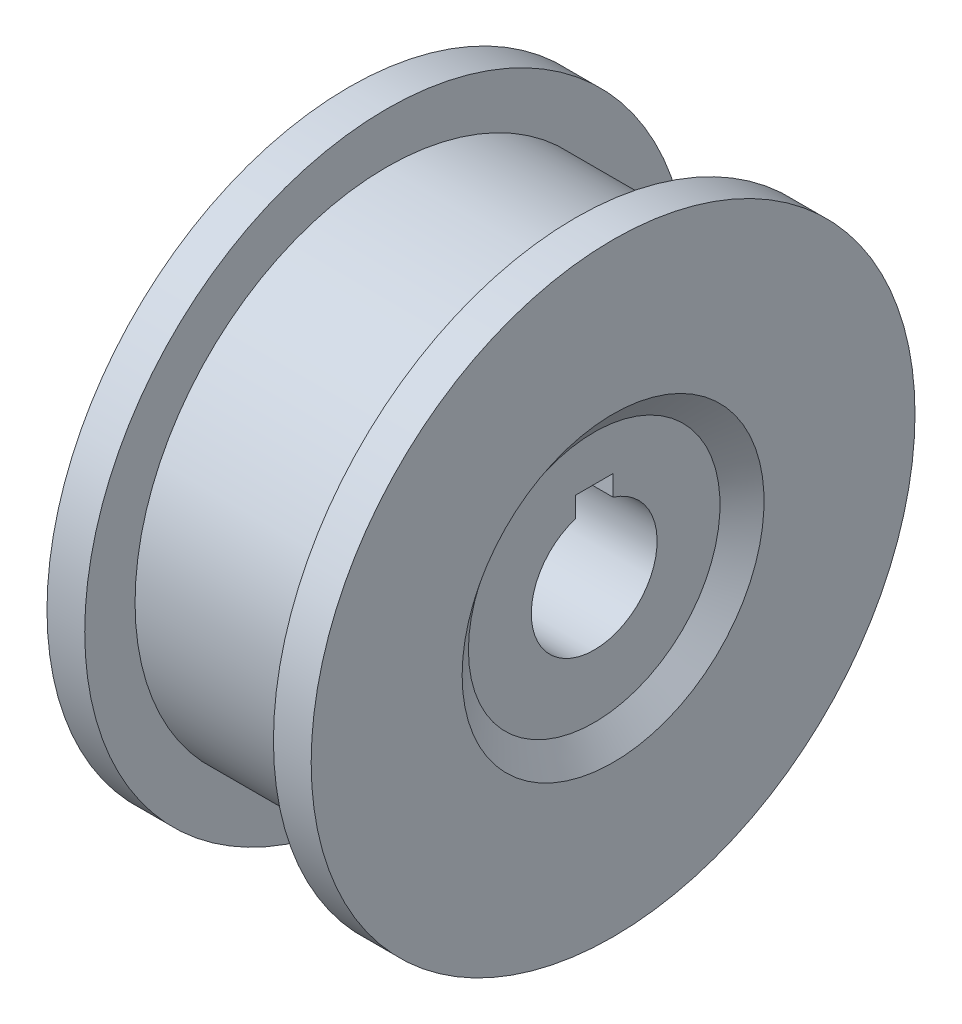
from build123d import *

# Parameters (mm, degrees)
ESQUISSE2_W             = 3
ESQUISSE2_H             = 6.4
ENL_V_MAT_EXTRU_1_DEPTH = 40.143965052


with BuildPart() as part:
    # Esquisse1 → R_volution1 (revolve)
    with BuildSketch(Plane.XY, mode=Mode.PRIVATE) as r_volution1_sk:
        Polygon((-9, 10), (-9, 5), (9, 5), (9, 10), (10.5, 12), (10.5, 24), (7.5, 24), (7.5, 20), (-7.5, 20), (-7.5, 24), (-10.5, 24), (-10.5, 12), align=None)
    revolve(r_volution1_sk.sketch.rotate(Axis((0, 0, 0), (1, 0, 0)), 90), axis=Axis((0, 0, 0), (1, 0, 0)))

    # Esquisse2 → Enl_v. mat.-Extru.1 (cut, through all)
    with BuildSketch(Plane(origin=(9, 0, 0), x_dir=(0, 0, -1), z_dir=(1, 0, 0))):
        with Locations((0, 3.2)):
            Rectangle(ESQUISSE2_W, ESQUISSE2_H)
    extrude(amount=-ENL_V_MAT_EXTRU_1_DEPTH, mode=Mode.SUBTRACT)


solid = part.part
